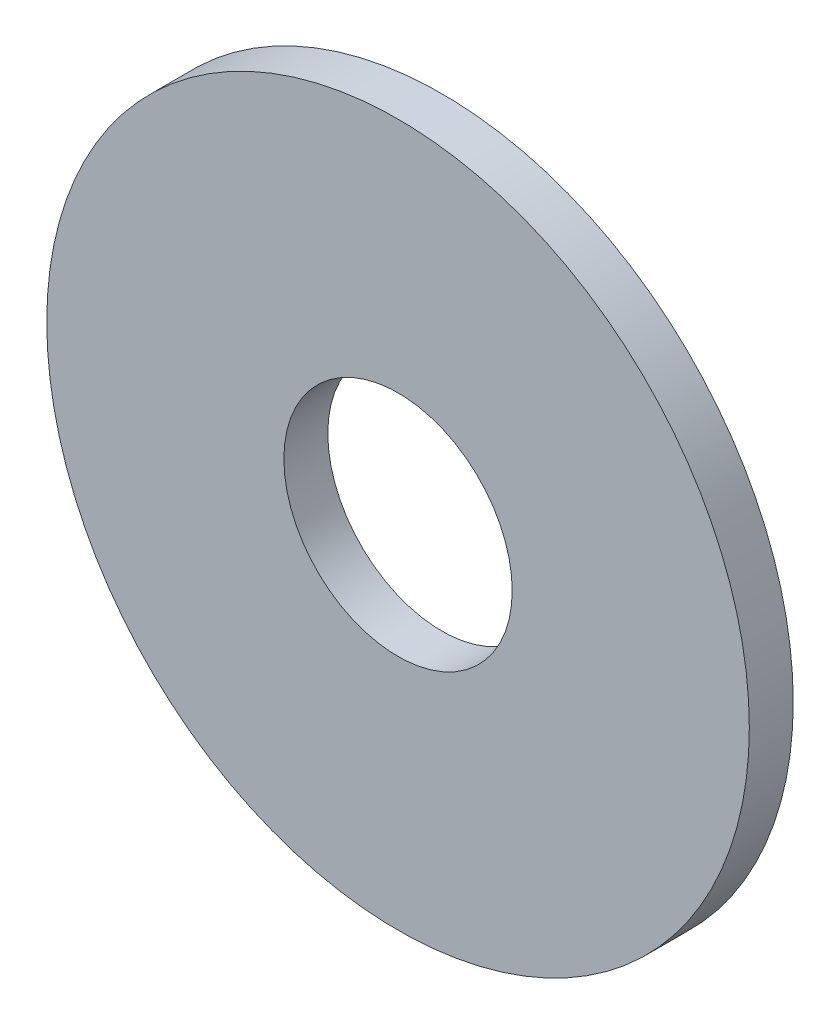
from build123d import *

# Parameters (mm, degrees)
E_CORPS_R              = 20
CORPS_DEPTH            = 2.5
E_PER_AGE_R            = 6.5
DIAM_TRE_NOMINAL_DEPTH = 29.394541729


with BuildPart() as part:
    # E_corps → Corps (new body)
    with BuildSketch(Plane.XY):
        Circle(E_CORPS_R)
    extrude(amount=CORPS_DEPTH)

    # E_per_age → Diam_tre_nominal (cut, through all)
    with BuildSketch(Plane(origin=(0, 0, 0), x_dir=(-1, 0, 0), z_dir=(0, 0, -1))):
        Circle(E_PER_AGE_R)
    extrude(amount=-DIAM_TRE_NOMINAL_DEPTH, mode=Mode.SUBTRACT)


solid = part.part
